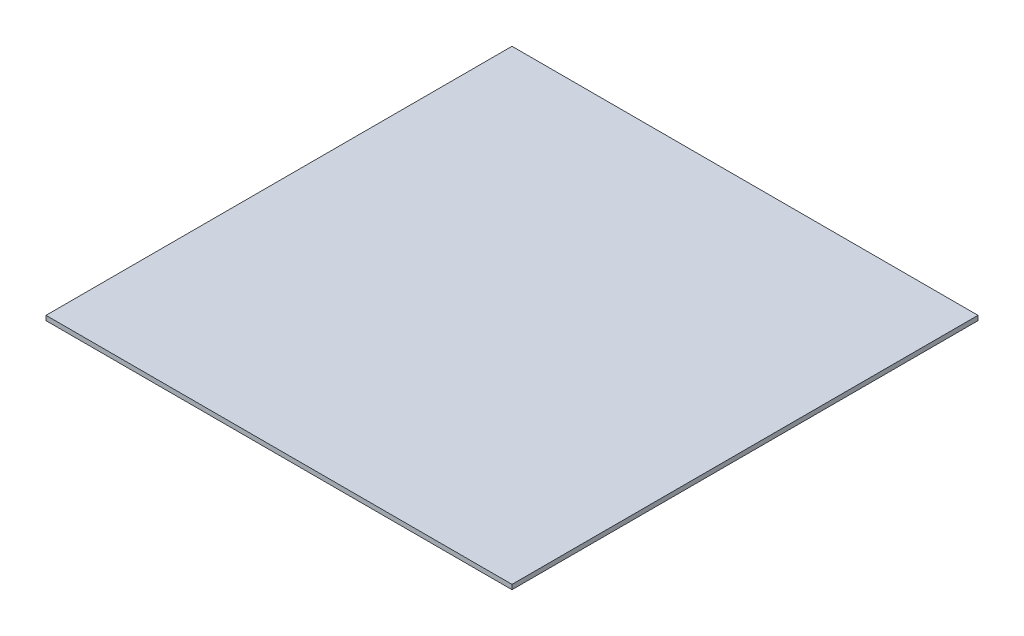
ISO-10303-21;
HEADER;
FILE_DESCRIPTION(('STEP AP214'),'2;1');
FILE_NAME('part.step','',(''),(''),'','','');
FILE_SCHEMA(('AUTOMOTIVE_DESIGN { 1 0 10303 214 1 1 1 1 }'));
ENDSEC;
DATA;
#1=APPLICATION_CONTEXT('core data for automotive mechanical design processes');
#2=APPLICATION_PROTOCOL_DEFINITION('international standard','automotive_design',2000,#1);
#3=PRODUCT_CONTEXT('',#1,'mechanical');
#4=PRODUCT('Part','Part','',(#3));
#5=PRODUCT_RELATED_PRODUCT_CATEGORY('part','',(#4));
#6=PRODUCT_DEFINITION_FORMATION('','',#4);
#7=PRODUCT_DEFINITION_CONTEXT('part definition',#1,'design');
#8=PRODUCT_DEFINITION('design','',#6,#7);
#9=PRODUCT_DEFINITION_SHAPE('','',#8);
#10=(LENGTH_UNIT() NAMED_UNIT(*) SI_UNIT(.MILLI.,.METRE.));
#11=(NAMED_UNIT(*) PLANE_ANGLE_UNIT() SI_UNIT($,.RADIAN.));
#12=(NAMED_UNIT(*) SI_UNIT($,.STERADIAN.) SOLID_ANGLE_UNIT());
#13=UNCERTAINTY_MEASURE_WITH_UNIT(LENGTH_MEASURE(1.E-05),#10,'distance_accuracy_value','');
#14=(GEOMETRIC_REPRESENTATION_CONTEXT(3) GLOBAL_UNCERTAINTY_ASSIGNED_CONTEXT((#13)) GLOBAL_UNIT_ASSIGNED_CONTEXT((#10,
#11,#12)) REPRESENTATION_CONTEXT('',''));
#15=CARTESIAN_POINT('',(0.,0.,0.));
#16=DIRECTION('',(0.,0.,1.));
#17=DIRECTION('',(1.,0.,0.));
#18=AXIS2_PLACEMENT_3D('',#15,#16,#17);
#19=CARTESIAN_POINT('',(-2500.,50.,2500.));
#20=DIRECTION('',(1.,0.,0.));
#21=DIRECTION('',(0.,0.,-1.));
#22=AXIS2_PLACEMENT_3D('',#19,#20,#21);
#23=PLANE('',#22);
#24=DIRECTION('',(0.,0.,1.));
#25=VECTOR('',#24,1.);
#26=CARTESIAN_POINT('',(-2500.,0.,2500.));
#27=LINE('',#26,#25);
#28=CARTESIAN_POINT('',(-2500.,0.,-2500.));
#29=VERTEX_POINT('',#28);
#30=CARTESIAN_POINT('',(-2500.,0.,2500.));
#31=VERTEX_POINT('',#30);
#32=EDGE_CURVE('E100',#29,#31,#27,.T.);
#33=ORIENTED_EDGE('',*,*,#32,.T.);
#34=DIRECTION('',(0.,-1.,0.));
#35=VECTOR('',#34,1.);
#36=CARTESIAN_POINT('',(-2500.,50.,2500.));
#37=LINE('',#36,#35);
#38=CARTESIAN_POINT('',(-2500.,50.,2500.));
#39=VERTEX_POINT('',#38);
#40=EDGE_CURVE('E11',#39,#31,#37,.T.);
#41=ORIENTED_EDGE('',*,*,#40,.F.);
#42=DIRECTION('',(0.,0.,1.));
#43=VECTOR('',#42,1.);
#44=CARTESIAN_POINT('',(-2500.,50.,2500.));
#45=LINE('',#44,#43);
#46=CARTESIAN_POINT('',(-2500.,50.,-2500.));
#47=VERTEX_POINT('',#46);
#48=EDGE_CURVE('E87',#47,#39,#45,.T.);
#49=ORIENTED_EDGE('',*,*,#48,.F.);
#50=DIRECTION('',(0.,-1.,0.));
#51=VECTOR('',#50,1.);
#52=CARTESIAN_POINT('',(-2500.,50.,-2500.));
#53=LINE('',#52,#51);
#54=EDGE_CURVE('E96',#47,#29,#53,.T.);
#55=ORIENTED_EDGE('',*,*,#54,.T.);
#56=EDGE_LOOP('',(#33,#41,#49,#55));
#57=FACE_BOUND('',#56,.T.);
#58=ADVANCED_FACE('F36',(#57),#23,.F.);
#59=CARTESIAN_POINT('',(2500.,50.,2500.));
#60=DIRECTION('',(0.,0.,-1.));
#61=DIRECTION('',(-1.,0.,0.));
#62=AXIS2_PLACEMENT_3D('',#59,#60,#61);
#63=PLANE('',#62);
#64=DIRECTION('',(1.,0.,0.));
#65=VECTOR('',#64,1.);
#66=CARTESIAN_POINT('',(2500.,0.,2500.));
#67=LINE('',#66,#65);
#68=CARTESIAN_POINT('',(2500.,0.,2500.));
#69=VERTEX_POINT('',#68);
#70=EDGE_CURVE('E91',#31,#69,#67,.T.);
#71=ORIENTED_EDGE('',*,*,#70,.T.);
#72=DIRECTION('',(0.,-1.,0.));
#73=VECTOR('',#72,1.);
#74=CARTESIAN_POINT('',(2500.,50.,2500.));
#75=LINE('',#74,#73);
#76=CARTESIAN_POINT('',(2500.,50.,2500.));
#77=VERTEX_POINT('',#76);
#78=EDGE_CURVE('E44',#77,#69,#75,.T.);
#79=ORIENTED_EDGE('',*,*,#78,.F.);
#80=DIRECTION('',(1.,0.,0.));
#81=VECTOR('',#80,1.);
#82=CARTESIAN_POINT('',(2500.,50.,2500.));
#83=LINE('',#82,#81);
#84=EDGE_CURVE('E82',#39,#77,#83,.T.);
#85=ORIENTED_EDGE('',*,*,#84,.F.);
#86=ORIENTED_EDGE('',*,*,#40,.T.);
#87=EDGE_LOOP('',(#71,#79,#85,#86));
#88=FACE_BOUND('',#87,.T.);
#89=ADVANCED_FACE('F90',(#88),#63,.F.);
#90=CARTESIAN_POINT('',(2500.,50.,2500.));
#91=DIRECTION('',(-1.,0.,0.));
#92=DIRECTION('',(0.,0.,1.));
#93=AXIS2_PLACEMENT_3D('',#90,#91,#92);
#94=PLANE('',#93);
#95=DIRECTION('',(0.,0.,-1.));
#96=VECTOR('',#95,1.);
#97=CARTESIAN_POINT('',(2500.,0.,2500.));
#98=LINE('',#97,#96);
#99=CARTESIAN_POINT('',(2500.,0.,-2500.));
#100=VERTEX_POINT('',#99);
#101=EDGE_CURVE('E69',#69,#100,#98,.T.);
#102=ORIENTED_EDGE('',*,*,#101,.T.);
#103=DIRECTION('',(0.,-1.,0.));
#104=VECTOR('',#103,1.);
#105=CARTESIAN_POINT('',(2500.,50.,-2500.));
#106=LINE('',#105,#104);
#107=CARTESIAN_POINT('',(2500.,50.,-2500.));
#108=VERTEX_POINT('',#107);
#109=EDGE_CURVE('E92',#108,#100,#106,.T.);
#110=ORIENTED_EDGE('',*,*,#109,.F.);
#111=DIRECTION('',(0.,0.,-1.));
#112=VECTOR('',#111,1.);
#113=CARTESIAN_POINT('',(2500.,50.,2500.));
#114=LINE('',#113,#112);
#115=EDGE_CURVE('E85',#77,#108,#114,.T.);
#116=ORIENTED_EDGE('',*,*,#115,.F.);
#117=ORIENTED_EDGE('',*,*,#78,.T.);
#118=EDGE_LOOP('',(#102,#110,#116,#117));
#119=FACE_BOUND('',#118,.T.);
#120=ADVANCED_FACE('F93',(#119),#94,.F.);
#121=CARTESIAN_POINT('',(2500.,50.,-2500.));
#122=DIRECTION('',(0.,0.,1.));
#123=DIRECTION('',(1.,0.,0.));
#124=AXIS2_PLACEMENT_3D('',#121,#122,#123);
#125=PLANE('',#124);
#126=DIRECTION('',(-1.,0.,0.));
#127=VECTOR('',#126,1.);
#128=CARTESIAN_POINT('',(2500.,0.,-2500.));
#129=LINE('',#128,#127);
#130=EDGE_CURVE('E75',#100,#29,#129,.T.);
#131=ORIENTED_EDGE('',*,*,#130,.T.);
#132=ORIENTED_EDGE('',*,*,#54,.F.);
#133=DIRECTION('',(-1.,0.,0.));
#134=VECTOR('',#133,1.);
#135=CARTESIAN_POINT('',(2500.,50.,-2500.));
#136=LINE('',#135,#134);
#137=EDGE_CURVE('E52',#108,#47,#136,.T.);
#138=ORIENTED_EDGE('',*,*,#137,.F.);
#139=ORIENTED_EDGE('',*,*,#109,.T.);
#140=EDGE_LOOP('',(#131,#132,#138,#139));
#141=FACE_BOUND('',#140,.T.);
#142=ADVANCED_FACE('F108',(#141),#125,.F.);
#143=CARTESIAN_POINT('',(0.,50.,0.));
#144=DIRECTION('',(0.,1.,0.));
#145=DIRECTION('',(0.,0.,1.));
#146=AXIS2_PLACEMENT_3D('',#143,#144,#145);
#147=PLANE('',#146);
#148=ORIENTED_EDGE('',*,*,#48,.T.);
#149=ORIENTED_EDGE('',*,*,#84,.T.);
#150=ORIENTED_EDGE('',*,*,#115,.T.);
#151=ORIENTED_EDGE('',*,*,#137,.T.);
#152=EDGE_LOOP('',(#148,#149,#150,#151));
#153=FACE_BOUND('',#152,.T.);
#154=ADVANCED_FACE('F83',(#153),#147,.T.);
#155=CARTESIAN_POINT('',(0.,0.,0.));
#156=DIRECTION('',(0.,1.,0.));
#157=DIRECTION('',(0.,0.,1.));
#158=AXIS2_PLACEMENT_3D('',#155,#156,#157);
#159=PLANE('',#158);
#160=ORIENTED_EDGE('',*,*,#32,.F.);
#161=ORIENTED_EDGE('',*,*,#130,.F.);
#162=ORIENTED_EDGE('',*,*,#101,.F.);
#163=ORIENTED_EDGE('',*,*,#70,.F.);
#164=EDGE_LOOP('',(#160,#161,#162,#163));
#165=FACE_BOUND('',#164,.T.);
#166=ADVANCED_FACE('F111',(#165),#159,.F.);
#167=CLOSED_SHELL('',(#58,#89,#120,#142,#154,#166));
#168=MANIFOLD_SOLID_BREP('B2',#167);
#169=ADVANCED_BREP_SHAPE_REPRESENTATION('',(#18,#168),#14);
#170=SHAPE_DEFINITION_REPRESENTATION(#9,#169);
ENDSEC;
END-ISO-10303-21;
